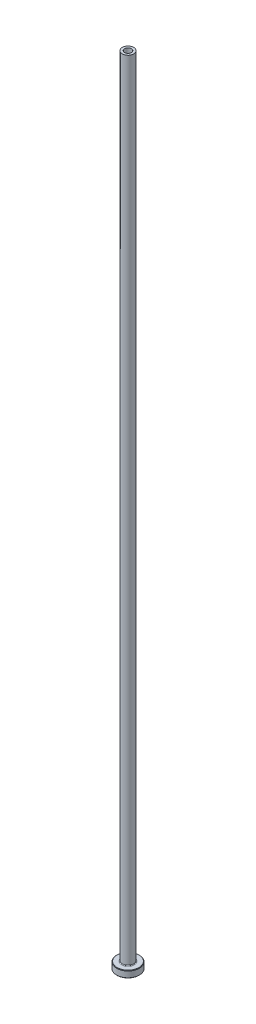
ISO-10303-21;
HEADER;
FILE_DESCRIPTION(('STEP AP214'),'2;1');
FILE_NAME('part.step','',(''),(''),'','','');
FILE_SCHEMA(('AUTOMOTIVE_DESIGN { 1 0 10303 214 1 1 1 1 }'));
ENDSEC;
DATA;
#1=APPLICATION_CONTEXT('core data for automotive mechanical design processes');
#2=APPLICATION_PROTOCOL_DEFINITION('international standard','automotive_design',2000,#1);
#3=PRODUCT_CONTEXT('',#1,'mechanical');
#4=PRODUCT('Part','Part','',(#3));
#5=PRODUCT_RELATED_PRODUCT_CATEGORY('part','',(#4));
#6=PRODUCT_DEFINITION_FORMATION('','',#4);
#7=PRODUCT_DEFINITION_CONTEXT('part definition',#1,'design');
#8=PRODUCT_DEFINITION('design','',#6,#7);
#9=PRODUCT_DEFINITION_SHAPE('','',#8);
#10=(LENGTH_UNIT() NAMED_UNIT(*) SI_UNIT(.MILLI.,.METRE.));
#11=(NAMED_UNIT(*) PLANE_ANGLE_UNIT() SI_UNIT($,.RADIAN.));
#12=(NAMED_UNIT(*) SI_UNIT($,.STERADIAN.) SOLID_ANGLE_UNIT());
#13=UNCERTAINTY_MEASURE_WITH_UNIT(LENGTH_MEASURE(1.E-05),#10,'distance_accuracy_value','');
#14=(GEOMETRIC_REPRESENTATION_CONTEXT(3) GLOBAL_UNCERTAINTY_ASSIGNED_CONTEXT((#13)) GLOBAL_UNIT_ASSIGNED_CONTEXT((#10,
#11,#12)) REPRESENTATION_CONTEXT('',''));
#15=CARTESIAN_POINT('',(0.,0.,0.));
#16=DIRECTION('',(0.,0.,1.));
#17=DIRECTION('',(1.,0.,0.));
#18=AXIS2_PLACEMENT_3D('',#15,#16,#17);
#19=CARTESIAN_POINT('',(0.,92.1876809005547,0.));
#20=DIRECTION('',(0.,1.,0.));
#21=DIRECTION('',(0.,0.,1.));
#22=AXIS2_PLACEMENT_3D('',#19,#20,#21);
#23=CYLINDRICAL_SURFACE('',#22,1.50000000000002);
#24=CARTESIAN_POINT('',(0.,350.,0.));
#25=DIRECTION('',(0.,1.,0.));
#26=DIRECTION('',(0.,0.,1.));
#27=AXIS2_PLACEMENT_3D('',#24,#25,#26);
#28=CIRCLE('',#27,1.50000000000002);
#29=CARTESIAN_POINT('',(0.,350.,1.50000000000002));
#30=VERTEX_POINT('',#29);
#31=EDGE_CURVE('E62',#30,#30,#28,.T.);
#32=ORIENTED_EDGE('',*,*,#31,.T.);
#33=EDGE_LOOP('',(#32));
#34=FACE_BOUND('',#33,.T.);
#35=CARTESIAN_POINT('',(0.,305.,0.));
#36=DIRECTION('',(0.,1.,0.));
#37=DIRECTION('',(0.,0.,1.));
#38=AXIS2_PLACEMENT_3D('',#35,#36,#37);
#39=CIRCLE('',#38,1.50000000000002);
#40=CARTESIAN_POINT('',(0.,305.,1.50000000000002));
#41=VERTEX_POINT('',#40);
#42=EDGE_CURVE('E71',#41,#41,#39,.T.);
#43=ORIENTED_EDGE('',*,*,#42,.F.);
#44=EDGE_LOOP('',(#43));
#45=FACE_BOUND('',#44,.T.);
#46=ADVANCED_FACE('F30',(#34,#45),#23,.F.);
#47=CARTESIAN_POINT('',(-1.50000000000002,350.,0.));
#48=DIRECTION('',(0.,1.,0.));
#49=DIRECTION('',(0.,0.,1.));
#50=AXIS2_PLACEMENT_3D('',#47,#48,#49);
#51=PLANE('',#50);
#52=CARTESIAN_POINT('',(0.,350.,0.));
#53=DIRECTION('',(0.,1.,0.));
#54=DIRECTION('',(0.,0.,1.));
#55=AXIS2_PLACEMENT_3D('',#52,#53,#54);
#56=CIRCLE('',#55,2.50000000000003);
#57=CARTESIAN_POINT('',(0.,350.,2.50000000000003));
#58=VERTEX_POINT('',#57);
#59=EDGE_CURVE('E65',#58,#58,#56,.T.);
#60=ORIENTED_EDGE('',*,*,#59,.T.);
#61=EDGE_LOOP('',(#60));
#62=FACE_BOUND('',#61,.T.);
#63=ORIENTED_EDGE('',*,*,#31,.F.);
#64=EDGE_LOOP('',(#63));
#65=FACE_BOUND('',#64,.T.);
#66=ADVANCED_FACE('F79',(#62,#65),#51,.T.);
#67=CARTESIAN_POINT('',(0.,92.1876809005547,0.));
#68=DIRECTION('',(0.,1.,0.));
#69=DIRECTION('',(0.,0.,1.));
#70=AXIS2_PLACEMENT_3D('',#67,#68,#69);
#71=CYLINDRICAL_SURFACE('',#70,2.50000000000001);
#72=CARTESIAN_POINT('',(0.,3.3,0.));
#73=DIRECTION('',(0.,1.,0.));
#74=DIRECTION('',(0.,0.,1.));
#75=AXIS2_PLACEMENT_3D('',#72,#73,#74);
#76=CIRCLE('',#75,2.50000000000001);
#77=CARTESIAN_POINT('',(0.,3.3,2.50000000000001));
#78=VERTEX_POINT('',#77);
#79=EDGE_CURVE('E59',#78,#78,#76,.T.);
#80=ORIENTED_EDGE('',*,*,#79,.T.);
#81=EDGE_LOOP('',(#80));
#82=FACE_BOUND('',#81,.T.);
#83=ORIENTED_EDGE('',*,*,#59,.F.);
#84=EDGE_LOOP('',(#83));
#85=FACE_BOUND('',#84,.T.);
#86=ADVANCED_FACE('F85',(#82,#85),#71,.T.);
#87=CARTESIAN_POINT('',(-2.49999999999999,3.,0.));
#88=DIRECTION('',(0.,1.,0.));
#89=DIRECTION('',(0.,0.,1.));
#90=AXIS2_PLACEMENT_3D('',#87,#88,#89);
#91=PLANE('',#90);
#92=CARTESIAN_POINT('',(0.,3.,0.));
#93=DIRECTION('',(0.,1.,0.));
#94=DIRECTION('',(0.,0.,1.));
#95=AXIS2_PLACEMENT_3D('',#92,#93,#94);
#96=CIRCLE('',#95,4.79999999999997);
#97=CARTESIAN_POINT('',(0.,3.,4.79999999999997));
#98=VERTEX_POINT('',#97);
#99=EDGE_CURVE('E53',#98,#98,#96,.T.);
#100=ORIENTED_EDGE('',*,*,#99,.T.);
#101=EDGE_LOOP('',(#100));
#102=FACE_BOUND('',#101,.T.);
#103=CARTESIAN_POINT('',(0.,3.,0.));
#104=DIRECTION('',(0.,1.,0.));
#105=DIRECTION('',(0.,0.,1.));
#106=AXIS2_PLACEMENT_3D('',#103,#104,#105);
#107=CIRCLE('',#106,2.80000000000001);
#108=CARTESIAN_POINT('',(0.,3.,2.80000000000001));
#109=VERTEX_POINT('',#108);
#110=EDGE_CURVE('E56',#109,#109,#107,.F.);
#111=ORIENTED_EDGE('',*,*,#110,.T.);
#112=EDGE_LOOP('',(#111));
#113=FACE_BOUND('',#112,.T.);
#114=ADVANCED_FACE('F111',(#102,#113),#91,.T.);
#115=CARTESIAN_POINT('',(0.,92.1876809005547,0.));
#116=DIRECTION('',(0.,1.,0.));
#117=DIRECTION('',(0.,0.,1.));
#118=AXIS2_PLACEMENT_3D('',#115,#116,#117);
#119=CYLINDRICAL_SURFACE('',#118,4.99999999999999);
#120=CARTESIAN_POINT('',(0.,2.80000000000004,0.));
#121=DIRECTION('',(0.,1.,0.));
#122=DIRECTION('',(0.,0.,1.));
#123=AXIS2_PLACEMENT_3D('',#120,#121,#122);
#124=CIRCLE('',#123,4.99999999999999);
#125=CARTESIAN_POINT('',(0.,2.80000000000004,4.99999999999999));
#126=VERTEX_POINT('',#125);
#127=EDGE_CURVE('E45',#126,#126,#124,.F.);
#128=ORIENTED_EDGE('',*,*,#127,.T.);
#129=EDGE_LOOP('',(#128));
#130=FACE_BOUND('',#129,.T.);
#131=CARTESIAN_POINT('',(0.,0.200000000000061,0.));
#132=DIRECTION('',(0.,-1.,0.));
#133=DIRECTION('',(0.,0.,-1.));
#134=AXIS2_PLACEMENT_3D('',#131,#132,#133);
#135=CIRCLE('',#134,4.99999999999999);
#136=CARTESIAN_POINT('',(0.,0.200000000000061,-4.99999999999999));
#137=VERTEX_POINT('',#136);
#138=EDGE_CURVE('E50',#137,#137,#135,.F.);
#139=ORIENTED_EDGE('',*,*,#138,.T.);
#140=EDGE_LOOP('',(#139));
#141=FACE_BOUND('',#140,.T.);
#142=ADVANCED_FACE('F108',(#130,#141),#119,.T.);
#143=CARTESIAN_POINT('',(-4.99999999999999,0.,0.));
#144=DIRECTION('',(0.,-1.,0.));
#145=DIRECTION('',(0.,0.,-1.));
#146=AXIS2_PLACEMENT_3D('',#143,#144,#145);
#147=PLANE('',#146);
#148=CARTESIAN_POINT('',(0.,0.,0.));
#149=DIRECTION('',(0.,-1.,0.));
#150=DIRECTION('',(0.,0.,-1.));
#151=AXIS2_PLACEMENT_3D('',#148,#149,#150);
#152=CIRCLE('',#151,2.24999999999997);
#153=CARTESIAN_POINT('',(0.,0.,-2.24999999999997));
#154=VERTEX_POINT('',#153);
#155=EDGE_CURVE('E37',#154,#154,#152,.F.);
#156=ORIENTED_EDGE('',*,*,#155,.T.);
#157=EDGE_LOOP('',(#156));
#158=FACE_BOUND('',#157,.T.);
#159=CARTESIAN_POINT('',(0.,0.,0.));
#160=DIRECTION('',(0.,-1.,0.));
#161=DIRECTION('',(0.,0.,-1.));
#162=AXIS2_PLACEMENT_3D('',#159,#160,#161);
#163=CIRCLE('',#162,4.79999999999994);
#164=CARTESIAN_POINT('',(0.,0.,-4.79999999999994));
#165=VERTEX_POINT('',#164);
#166=EDGE_CURVE('E41',#165,#165,#163,.T.);
#167=ORIENTED_EDGE('',*,*,#166,.T.);
#168=EDGE_LOOP('',(#167));
#169=FACE_BOUND('',#168,.T.);
#170=ADVANCED_FACE('F110',(#158,#169),#147,.T.);
#171=CARTESIAN_POINT('',(0.,92.1876809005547,0.));
#172=DIRECTION('',(0.,1.,0.));
#173=DIRECTION('',(0.,0.,1.));
#174=AXIS2_PLACEMENT_3D('',#171,#172,#173);
#175=CYLINDRICAL_SURFACE('',#174,1.75000000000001);
#176=CARTESIAN_POINT('',(0.,0.499999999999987,0.));
#177=DIRECTION('',(0.,-1.,0.));
#178=DIRECTION('',(0.,0.,-1.));
#179=AXIS2_PLACEMENT_3D('',#176,#177,#178);
#180=CIRCLE('',#179,1.75000000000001);
#181=CARTESIAN_POINT('',(0.,0.499999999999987,-1.75000000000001));
#182=VERTEX_POINT('',#181);
#183=EDGE_CURVE('E10',#182,#182,#180,.T.);
#184=ORIENTED_EDGE('',*,*,#183,.T.);
#185=EDGE_LOOP('',(#184));
#186=FACE_BOUND('',#185,.T.);
#187=CARTESIAN_POINT('',(0.,293.,0.));
#188=DIRECTION('',(0.,1.,0.));
#189=DIRECTION('',(0.,0.,1.));
#190=AXIS2_PLACEMENT_3D('',#187,#188,#189);
#191=CIRCLE('',#190,1.75000000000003);
#192=CARTESIAN_POINT('',(0.,293.,1.75000000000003));
#193=VERTEX_POINT('',#192);
#194=EDGE_CURVE('E68',#193,#193,#191,.T.);
#195=ORIENTED_EDGE('',*,*,#194,.T.);
#196=EDGE_LOOP('',(#195));
#197=FACE_BOUND('',#196,.T.);
#198=ADVANCED_FACE('F118',(#186,#197),#175,.F.);
#199=CARTESIAN_POINT('',(0.,293.,0.));
#200=DIRECTION('',(0.,-1.,0.));
#201=DIRECTION('',(0.,0.,-1.));
#202=AXIS2_PLACEMENT_3D('',#199,#200,#201);
#203=CONICAL_SURFACE('',#202,1.75000000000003,0.0208303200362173);
#204=ORIENTED_EDGE('',*,*,#42,.T.);
#205=EDGE_LOOP('',(#204));
#206=FACE_BOUND('',#205,.T.);
#207=ORIENTED_EDGE('',*,*,#194,.F.);
#208=EDGE_LOOP('',(#207));
#209=FACE_BOUND('',#208,.T.);
#210=ADVANCED_FACE('F75',(#206,#209),#203,.F.);
#211=CARTESIAN_POINT('',(0.,3.3,0.));
#212=DIRECTION('',(0.,1.,0.));
#213=DIRECTION('',(0.,0.,1.));
#214=AXIS2_PLACEMENT_3D('',#211,#212,#213);
#215=TOROIDAL_SURFACE('',#214,2.80000000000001,0.3);
#216=ORIENTED_EDGE('',*,*,#110,.F.);
#217=EDGE_LOOP('',(#216));
#218=FACE_BOUND('',#217,.T.);
#219=ORIENTED_EDGE('',*,*,#79,.F.);
#220=EDGE_LOOP('',(#219));
#221=FACE_BOUND('',#220,.T.);
#222=ADVANCED_FACE('F90',(#218,#221),#215,.F.);
#223=CARTESIAN_POINT('',(0.,3.,0.));
#224=DIRECTION('',(0.,-1.,0.));
#225=DIRECTION('',(0.,0.,-1.));
#226=AXIS2_PLACEMENT_3D('',#223,#224,#225);
#227=CONICAL_SURFACE('',#226,4.79999999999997,0.785398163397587);
#228=ORIENTED_EDGE('',*,*,#127,.F.);
#229=EDGE_LOOP('',(#228));
#230=FACE_BOUND('',#229,.T.);
#231=ORIENTED_EDGE('',*,*,#99,.F.);
#232=EDGE_LOOP('',(#231));
#233=FACE_BOUND('',#232,.T.);
#234=ADVANCED_FACE('F93',(#230,#233),#227,.T.);
#235=CARTESIAN_POINT('',(0.,0.200000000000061,0.));
#236=DIRECTION('',(0.,1.,0.));
#237=DIRECTION('',(0.,0.,1.));
#238=AXIS2_PLACEMENT_3D('',#235,#236,#237);
#239=CONICAL_SURFACE('',#238,4.99999999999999,0.785398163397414);
#240=ORIENTED_EDGE('',*,*,#166,.F.);
#241=EDGE_LOOP('',(#240));
#242=FACE_BOUND('',#241,.T.);
#243=ORIENTED_EDGE('',*,*,#138,.F.);
#244=EDGE_LOOP('',(#243));
#245=FACE_BOUND('',#244,.T.);
#246=ADVANCED_FACE('F96',(#242,#245),#239,.T.);
#247=CARTESIAN_POINT('',(0.,0.,0.));
#248=DIRECTION('',(0.,-1.,0.));
#249=DIRECTION('',(0.,0.,-1.));
#250=AXIS2_PLACEMENT_3D('',#247,#248,#249);
#251=CONICAL_SURFACE('',#250,2.24999999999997,0.785398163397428);
#252=ORIENTED_EDGE('',*,*,#183,.F.);
#253=EDGE_LOOP('',(#252));
#254=FACE_BOUND('',#253,.T.);
#255=ORIENTED_EDGE('',*,*,#155,.F.);
#256=EDGE_LOOP('',(#255));
#257=FACE_BOUND('',#256,.T.);
#258=ADVANCED_FACE('F32',(#254,#257),#251,.F.);
#259=CLOSED_SHELL('',(#46,#66,#86,#114,#142,#170,#198,#210,#222,#234,#246,#258));
#260=MANIFOLD_SOLID_BREP('B2',#259);
#261=ADVANCED_BREP_SHAPE_REPRESENTATION('',(#18,#260),#14);
#262=SHAPE_DEFINITION_REPRESENTATION(#9,#261);
ENDSEC;
END-ISO-10303-21;
